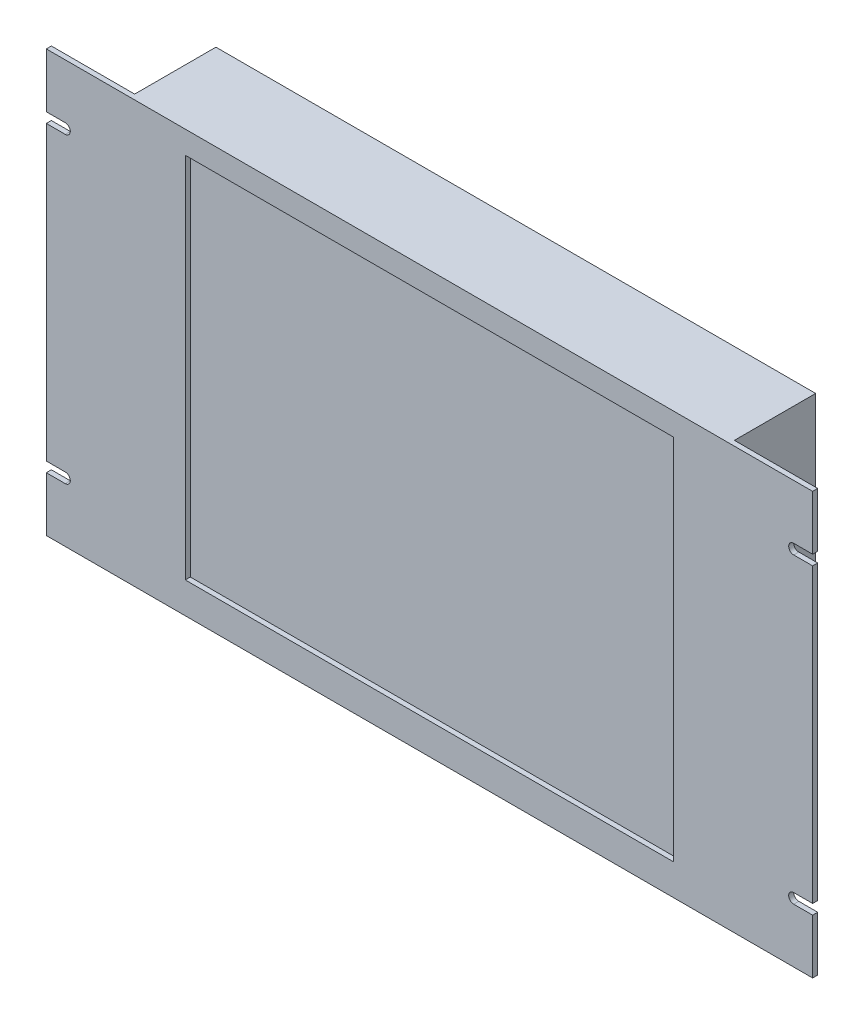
from build123d import *

# Parameters (mm, degrees)
SKETCH1_W           = 307.594
SKETCH1_H           = 231.648
BOSS_EXTRUDE1_DEPTH = 3.175
SKETCH2_W           = 377.698
SKETCH2_H           = 265.43
BOSS_EXTRUDE2_DEPTH = 51.181
SKETCH5_W           = 215.784160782
SKETCH5_H           = 80.213177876
CUT_EXTRUDE1_DEPTH  = 28.956
SKETCH4_R           = 5.588
SKETCH4_R_2         = 1.9812
SKETCH4_R_3         = 2.3876
SKETCH4_W           = 2.54
SKETCH4_H           = 12.7
CUT_EXTRUDE2_DEPTH  = 0.508


with BuildPart() as part:
    # Sketch1 → Boss-Extrude1 (new body)
    with BuildSketch(Plane.XY):
        with BuildLine():
            Line((-241.299997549, 106.299), (-229.387396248, 106.299))
            ThreePointArc((-229.387396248, 106.299), (-226.212396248, 109.474), (-229.387396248, 112.649))
            Line((-229.387396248, 112.649), (-241.299997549, 112.649))
            Line((-241.299997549, 112.649), (-241.299997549, 146.939))
            Line((-241.299997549, 146.939), (241.299997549, 146.939))
            Line((241.299997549, 146.939), (241.299997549, 112.649))
            Line((241.299997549, 112.649), (229.387396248, 112.649))
            ThreePointArc((229.387396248, 112.649), (226.212396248, 109.474), (229.387396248, 106.299))
            Line((229.387396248, 106.299), (241.299997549, 106.299))
            Line((241.299997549, 106.299), (241.299997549, -77.851))
            Line((241.299997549, -77.851), (229.387396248, -77.851))
            ThreePointArc((229.387396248, -77.851), (226.212396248, -81.026), (229.387396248, -84.201))
            Line((229.387396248, -84.201), (241.299997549, -84.201))
            Line((241.299997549, -84.201), (241.299997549, -118.491))
            Line((241.299997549, -118.491), (-241.299997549, -118.491))
            Line((-241.299997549, -118.491), (-241.299997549, -84.201))
            Line((-241.299997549, -84.201), (-229.387396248, -84.201))
            ThreePointArc((-229.387396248, -84.201), (-226.212396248, -81.026), (-229.387396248, -77.851))
            Line((-229.387396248, -77.851), (-241.299997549, -77.851))
            Line((-241.299997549, -77.851), (-241.299997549, 106.299))
        make_face()
        with Locations((0, 16.891)):
            Rectangle(SKETCH1_W, SKETCH1_H, mode=Mode.SUBTRACT)
    extrude(amount=BOSS_EXTRUDE1_DEPTH)

    # Sketch2 → Boss-Extrude2 (add)
    with BuildSketch(Plane(origin=(0, 0, 0), x_dir=(-1, 0, 0), z_dir=(0, 0, -1))):
        with Locations((0, 14.224)):
            Rectangle(SKETCH2_W, SKETCH2_H)
    extrude(amount=BOSS_EXTRUDE2_DEPTH)

    # Sketch5 → Cut-Extrude1 (cut)
    with BuildSketch(Plane(origin=(0, 0, -51.181), x_dir=(-1, 0, 0), z_dir=(0, 0, -1))):
        with Locations((80.956919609, -78.384411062)):
            Rectangle(SKETCH5_W, SKETCH5_H)
    extrude(amount=-CUT_EXTRUDE1_DEPTH, mode=Mode.SUBTRACT)

    # Sketch4 → Cut-Extrude2 (cut)
    with BuildSketch(Plane(origin=(0, 0, -51.181), x_dir=(-1, 0, 0), z_dir=(0, 0, -1))):
        with Locations((21.89878151, 106.187062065)):
            Circle(SKETCH4_R)
        with Locations((36.89878151, 106.187062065)):
            Circle(SKETCH4_R)
        with Locations((51.89878151, 106.187062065)):
            Circle(SKETCH4_R)
        with Locations((66.89878151, 106.187062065)):
            Circle(SKETCH4_R)
        with Locations((96.898781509, 106.187062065)):
            Circle(SKETCH4_R)
        with Locations((81.898781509, 106.283639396)):
            Circle(SKETCH4_R_2)
        with Locations((-153.226755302, 86.875148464)):
            Circle(SKETCH4_R_3)
        with Locations((-153.226755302, -30.642762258)):
            Circle(SKETCH4_R_3)
        with Locations((179.106061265, 86.875148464)):
            Circle(SKETCH4_R_3)
        with Locations((179.106061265, -30.642762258)):
            Circle(SKETCH4_R_3)
        with Locations((105.502212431, 125.458185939)):
            Rectangle(SKETCH4_W, SKETCH4_H)
        with Locations((111.852212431, 125.458185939)):
            Rectangle(SKETCH4_W, SKETCH4_H)
        with Locations((118.202212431, 125.458185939)):
            Rectangle(SKETCH4_W, SKETCH4_H)
        with Locations((124.552212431, 125.458185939)):
            Rectangle(SKETCH4_W, SKETCH4_H)
        with Locations((130.902212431, 125.458185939)):
            Rectangle(SKETCH4_W, SKETCH4_H)
        with Locations((137.252212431, 125.458185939)):
            Rectangle(SKETCH4_W, SKETCH4_H)
        with Locations((143.602212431, 125.458185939)):
            Rectangle(SKETCH4_W, SKETCH4_H)
        with Locations((149.952212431, 125.458185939)):
            Rectangle(SKETCH4_W, SKETCH4_H)
        with Locations((156.302212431, 125.458185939)):
            Rectangle(SKETCH4_W, SKETCH4_H)
        with Locations((162.652212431, 125.458185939)):
            Rectangle(SKETCH4_W, SKETCH4_H)
        with Locations((68.952023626, 27.003034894)):
            Rectangle(SKETCH4_W, SKETCH4_H)
        with Locations((75.302023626, 27.003034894)):
            Rectangle(SKETCH4_W, SKETCH4_H)
        with Locations((68.952023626, 7.953034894)):
            Rectangle(SKETCH4_W, SKETCH4_H)
        with Locations((75.302023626, 7.953034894)):
            Rectangle(SKETCH4_W, SKETCH4_H)
        with Locations((81.652023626, 27.003034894)):
            Rectangle(SKETCH4_W, SKETCH4_H)
        with Locations((88.002023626, 27.003034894)):
            Rectangle(SKETCH4_W, SKETCH4_H)
        with Locations((94.352023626, 27.003034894)):
            Rectangle(SKETCH4_W, SKETCH4_H)
        with Locations((100.702023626, 27.003034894)):
            Rectangle(SKETCH4_W, SKETCH4_H)
        with Locations((81.652023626, 7.953034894)):
            Rectangle(SKETCH4_W, SKETCH4_H)
        with Locations((88.002023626, 7.953034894)):
            Rectangle(SKETCH4_W, SKETCH4_H)
        with Locations((94.352023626, 7.953034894)):
            Rectangle(SKETCH4_W, SKETCH4_H)
        with Locations((100.702023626, 7.953034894)):
            Rectangle(SKETCH4_W, SKETCH4_H)
        with Locations((107.052023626, 27.003034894)):
            Rectangle(SKETCH4_W, SKETCH4_H)
        with Locations((113.402023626, 27.003034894)):
            Rectangle(SKETCH4_W, SKETCH4_H)
        with Locations((119.752023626, 27.003034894)):
            Rectangle(SKETCH4_W, SKETCH4_H)
        with Locations((107.052023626, 7.953034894)):
            Rectangle(SKETCH4_W, SKETCH4_H)
        with Locations((113.402023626, 7.953034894)):
            Rectangle(SKETCH4_W, SKETCH4_H)
        with Locations((119.752023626, 7.953034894)):
            Rectangle(SKETCH4_W, SKETCH4_H)
        with Locations((-104.041396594, 125.458185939)):
            Rectangle(SKETCH4_W, SKETCH4_H)
        with Locations((-110.391396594, 125.458185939)):
            Rectangle(SKETCH4_W, SKETCH4_H)
        with Locations((-116.741396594, 125.458185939)):
            Rectangle(SKETCH4_W, SKETCH4_H)
        with Locations((-104.041396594, 106.408185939)):
            Rectangle(SKETCH4_W, SKETCH4_H)
        with Locations((-110.391396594, 106.408185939)):
            Rectangle(SKETCH4_W, SKETCH4_H)
        with Locations((-116.741396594, 106.408185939)):
            Rectangle(SKETCH4_W, SKETCH4_H)
        with Locations((-123.091396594, 125.458185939)):
            Rectangle(SKETCH4_W, SKETCH4_H)
        with Locations((-123.091396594, 106.408185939)):
            Rectangle(SKETCH4_W, SKETCH4_H)
        with Locations((-129.441396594, 125.458185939)):
            Rectangle(SKETCH4_W, SKETCH4_H)
        with Locations((-129.441396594, 106.408185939)):
            Rectangle(SKETCH4_W, SKETCH4_H)
        with Locations((-135.791396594, 125.458185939)):
            Rectangle(SKETCH4_W, SKETCH4_H)
        with Locations((-135.791396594, 106.408185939)):
            Rectangle(SKETCH4_W, SKETCH4_H)
        with Locations((-142.141396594, 125.458185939)):
            Rectangle(SKETCH4_W, SKETCH4_H)
        with Locations((-142.141396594, 106.408185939)):
            Rectangle(SKETCH4_W, SKETCH4_H)
        with Locations((-148.491396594, 125.458185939)):
            Rectangle(SKETCH4_W, SKETCH4_H)
        with Locations((-148.491396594, 106.408185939)):
            Rectangle(SKETCH4_W, SKETCH4_H)
        with Locations((-154.841396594, 125.458185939)):
            Rectangle(SKETCH4_W, SKETCH4_H)
        with Locations((-154.841396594, 106.408185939)):
            Rectangle(SKETCH4_W, SKETCH4_H)
        with Locations((-161.191396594, 125.458185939)):
            Rectangle(SKETCH4_W, SKETCH4_H)
        with Locations((-161.191396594, 106.408185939)):
            Rectangle(SKETCH4_W, SKETCH4_H)
        with Locations((-78.641396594, 125.458185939)):
            Rectangle(SKETCH4_W, SKETCH4_H)
        with Locations((-84.991396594, 125.458185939)):
            Rectangle(SKETCH4_W, SKETCH4_H)
        with Locations((-91.341396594, 125.458185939)):
            Rectangle(SKETCH4_W, SKETCH4_H)
        with Locations((-78.641396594, 106.408185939)):
            Rectangle(SKETCH4_W, SKETCH4_H)
        with Locations((-84.991396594, 106.408185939)):
            Rectangle(SKETCH4_W, SKETCH4_H)
        with Locations((-91.341396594, 106.408185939)):
            Rectangle(SKETCH4_W, SKETCH4_H)
        with Locations((-97.691396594, 125.458185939)):
            Rectangle(SKETCH4_W, SKETCH4_H)
        with Locations((-97.691396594, 106.408185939)):
            Rectangle(SKETCH4_W, SKETCH4_H)
        with Locations((80.102212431, 125.458185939)):
            Rectangle(SKETCH4_W, SKETCH4_H)
        with Locations((86.452212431, 125.458185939)):
            Rectangle(SKETCH4_W, SKETCH4_H)
        with Locations((92.802212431, 125.458185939)):
            Rectangle(SKETCH4_W, SKETCH4_H)
        with Locations((99.152212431, 125.458185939)):
            Rectangle(SKETCH4_W, SKETCH4_H)
        with Locations((-53.241396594, 125.458185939)):
            Rectangle(SKETCH4_W, SKETCH4_H)
        with Locations((-59.591396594, 125.458185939)):
            Rectangle(SKETCH4_W, SKETCH4_H)
        with Locations((-65.941396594, 125.458185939)):
            Rectangle(SKETCH4_W, SKETCH4_H)
        with Locations((-72.291396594, 125.458185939)):
            Rectangle(SKETCH4_W, SKETCH4_H)
        with Locations((-27.841396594, 125.458185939)):
            Rectangle(SKETCH4_W, SKETCH4_H)
        with Locations((-34.191396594, 125.458185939)):
            Rectangle(SKETCH4_W, SKETCH4_H)
        with Locations((-40.541396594, 125.458185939)):
            Rectangle(SKETCH4_W, SKETCH4_H)
        with Locations((-46.891396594, 125.458185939)):
            Rectangle(SKETCH4_W, SKETCH4_H)
        with Locations((-2.441396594, 125.458185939)):
            Rectangle(SKETCH4_W, SKETCH4_H)
        with Locations((-8.791396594, 125.458185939)):
            Rectangle(SKETCH4_W, SKETCH4_H)
        with Locations((-15.141396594, 125.458185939)):
            Rectangle(SKETCH4_W, SKETCH4_H)
        with Locations((-21.491396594, 125.458185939)):
            Rectangle(SKETCH4_W, SKETCH4_H)
        with Locations((22.958603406, 125.458185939)):
            Rectangle(SKETCH4_W, SKETCH4_H)
        with Locations((16.608603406, 125.458185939)):
            Rectangle(SKETCH4_W, SKETCH4_H)
        with Locations((10.258603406, 125.458185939)):
            Rectangle(SKETCH4_W, SKETCH4_H)
        with Locations((3.908603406, 125.458185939)):
            Rectangle(SKETCH4_W, SKETCH4_H)
        with Locations((48.358603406, 125.458185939)):
            Rectangle(SKETCH4_W, SKETCH4_H)
        with Locations((42.008603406, 125.458185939)):
            Rectangle(SKETCH4_W, SKETCH4_H)
        with Locations((35.658603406, 125.458185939)):
            Rectangle(SKETCH4_W, SKETCH4_H)
        with Locations((29.308603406, 125.458185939)):
            Rectangle(SKETCH4_W, SKETCH4_H)
        with Locations((73.758603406, 125.458185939)):
            Rectangle(SKETCH4_W, SKETCH4_H)
        with Locations((67.408603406, 125.458185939)):
            Rectangle(SKETCH4_W, SKETCH4_H)
        with Locations((61.058603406, 125.458185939)):
            Rectangle(SKETCH4_W, SKETCH4_H)
        with Locations((54.708603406, 125.458185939)):
            Rectangle(SKETCH4_W, SKETCH4_H)
        with Locations((68.952023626, -11.096965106)):
            Rectangle(SKETCH4_W, SKETCH4_H)
        with Locations((75.302023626, -11.096965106)):
            Rectangle(SKETCH4_W, SKETCH4_H)
        with Locations((81.652023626, -11.096965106)):
            Rectangle(SKETCH4_W, SKETCH4_H)
        with Locations((88.002023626, -11.096965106)):
            Rectangle(SKETCH4_W, SKETCH4_H)
        with Locations((94.352023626, -11.096965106)):
            Rectangle(SKETCH4_W, SKETCH4_H)
        with Locations((100.702023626, -11.096965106)):
            Rectangle(SKETCH4_W, SKETCH4_H)
        with Locations((107.052023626, -11.096965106)):
            Rectangle(SKETCH4_W, SKETCH4_H)
        with Locations((113.402023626, -11.096965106)):
            Rectangle(SKETCH4_W, SKETCH4_H)
        with Locations((119.752023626, -11.096965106)):
            Rectangle(SKETCH4_W, SKETCH4_H)
        with Locations((-104.041396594, 87.358185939)):
            Rectangle(SKETCH4_W, SKETCH4_H)
        with Locations((-110.391396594, 87.358185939)):
            Rectangle(SKETCH4_W, SKETCH4_H)
        with Locations((-116.741396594, 87.358185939)):
            Rectangle(SKETCH4_W, SKETCH4_H)
        with Locations((-123.091396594, 87.358185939)):
            Rectangle(SKETCH4_W, SKETCH4_H)
        with Locations((-129.441396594, 87.358185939)):
            Rectangle(SKETCH4_W, SKETCH4_H)
        with Locations((-135.791396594, 87.358185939)):
            Rectangle(SKETCH4_W, SKETCH4_H)
        with Locations((-142.141396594, 87.358185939)):
            Rectangle(SKETCH4_W, SKETCH4_H)
        with Locations((-104.041396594, 68.308185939)):
            Rectangle(SKETCH4_W, SKETCH4_H)
        with Locations((-110.391396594, 68.308185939)):
            Rectangle(SKETCH4_W, SKETCH4_H)
        with Locations((-116.741396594, 68.308185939)):
            Rectangle(SKETCH4_W, SKETCH4_H)
        with Locations((-123.091396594, 68.308185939)):
            Rectangle(SKETCH4_W, SKETCH4_H)
        with Locations((-129.441396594, 68.308185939)):
            Rectangle(SKETCH4_W, SKETCH4_H)
        with Locations((-135.791396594, 68.308185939)):
            Rectangle(SKETCH4_W, SKETCH4_H)
        with Locations((-142.141396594, 68.308185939)):
            Rectangle(SKETCH4_W, SKETCH4_H)
        with Locations((-148.491396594, 68.308185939)):
            Rectangle(SKETCH4_W, SKETCH4_H)
        with Locations((-154.841396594, 68.308185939)):
            Rectangle(SKETCH4_W, SKETCH4_H)
        with Locations((-104.041396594, 49.258185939)):
            Rectangle(SKETCH4_W, SKETCH4_H)
        with Locations((-110.391396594, 49.258185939)):
            Rectangle(SKETCH4_W, SKETCH4_H)
        with Locations((-116.741396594, 49.258185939)):
            Rectangle(SKETCH4_W, SKETCH4_H)
        with Locations((-123.091396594, 49.258185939)):
            Rectangle(SKETCH4_W, SKETCH4_H)
        with Locations((-129.441396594, 49.258185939)):
            Rectangle(SKETCH4_W, SKETCH4_H)
        with Locations((-135.791396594, 49.258185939)):
            Rectangle(SKETCH4_W, SKETCH4_H)
        with Locations((-142.141396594, 49.258185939)):
            Rectangle(SKETCH4_W, SKETCH4_H)
        with Locations((-148.491396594, 49.258185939)):
            Rectangle(SKETCH4_W, SKETCH4_H)
        with Locations((-154.841396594, 49.258185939)):
            Rectangle(SKETCH4_W, SKETCH4_H)
        with Locations((-161.191396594, 49.258185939)):
            Rectangle(SKETCH4_W, SKETCH4_H)
        with Locations((-104.041396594, 30.208185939)):
            Rectangle(SKETCH4_W, SKETCH4_H)
        with Locations((-110.391396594, 30.208185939)):
            Rectangle(SKETCH4_W, SKETCH4_H)
        with Locations((-116.741396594, 30.208185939)):
            Rectangle(SKETCH4_W, SKETCH4_H)
        with Locations((-123.091396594, 30.208185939)):
            Rectangle(SKETCH4_W, SKETCH4_H)
        with Locations((-129.441396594, 30.208185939)):
            Rectangle(SKETCH4_W, SKETCH4_H)
        with Locations((-135.791396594, 30.208185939)):
            Rectangle(SKETCH4_W, SKETCH4_H)
        with Locations((-142.141396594, 30.208185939)):
            Rectangle(SKETCH4_W, SKETCH4_H)
        with Locations((-148.491396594, 30.208185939)):
            Rectangle(SKETCH4_W, SKETCH4_H)
        with Locations((-154.841396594, 30.208185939)):
            Rectangle(SKETCH4_W, SKETCH4_H)
        with Locations((-161.191396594, 30.208185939)):
            Rectangle(SKETCH4_W, SKETCH4_H)
        with Locations((-104.041396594, 11.158185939)):
            Rectangle(SKETCH4_W, SKETCH4_H)
        with Locations((-110.391396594, 11.158185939)):
            Rectangle(SKETCH4_W, SKETCH4_H)
        with Locations((-116.741396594, 11.158185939)):
            Rectangle(SKETCH4_W, SKETCH4_H)
        with Locations((-123.091396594, 11.158185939)):
            Rectangle(SKETCH4_W, SKETCH4_H)
        with Locations((-129.441396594, 11.158185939)):
            Rectangle(SKETCH4_W, SKETCH4_H)
        with Locations((-135.791396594, 11.158185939)):
            Rectangle(SKETCH4_W, SKETCH4_H)
        with Locations((-142.141396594, 11.158185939)):
            Rectangle(SKETCH4_W, SKETCH4_H)
        with Locations((-148.491396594, 11.158185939)):
            Rectangle(SKETCH4_W, SKETCH4_H)
        with Locations((-154.841396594, 11.158185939)):
            Rectangle(SKETCH4_W, SKETCH4_H)
        with Locations((-161.191396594, 11.158185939)):
            Rectangle(SKETCH4_W, SKETCH4_H)
        with Locations((-129.441396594, -7.891814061)):
            Rectangle(SKETCH4_W, SKETCH4_H)
        with Locations((-135.791396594, -7.891814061)):
            Rectangle(SKETCH4_W, SKETCH4_H)
        with Locations((-142.141396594, -7.891814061)):
            Rectangle(SKETCH4_W, SKETCH4_H)
        with Locations((-148.491396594, -7.891814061)):
            Rectangle(SKETCH4_W, SKETCH4_H)
        with Locations((-154.841396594, -7.891814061)):
            Rectangle(SKETCH4_W, SKETCH4_H)
        with Locations((-161.191396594, -7.891814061)):
            Rectangle(SKETCH4_W, SKETCH4_H)
        with Locations((-65.941396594, 106.408185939)):
            Rectangle(SKETCH4_W, SKETCH4_H)
        with Locations((-72.291396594, 106.408185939)):
            Rectangle(SKETCH4_W, SKETCH4_H)
        with Locations((169.002212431, 125.458185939)):
            Rectangle(SKETCH4_W, SKETCH4_H)
        with Locations((-161.191396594, 68.308185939)):
            Rectangle(SKETCH4_W, SKETCH4_H)
    extrude(amount=-CUT_EXTRUDE2_DEPTH, mode=Mode.SUBTRACT)


solid = part.part
